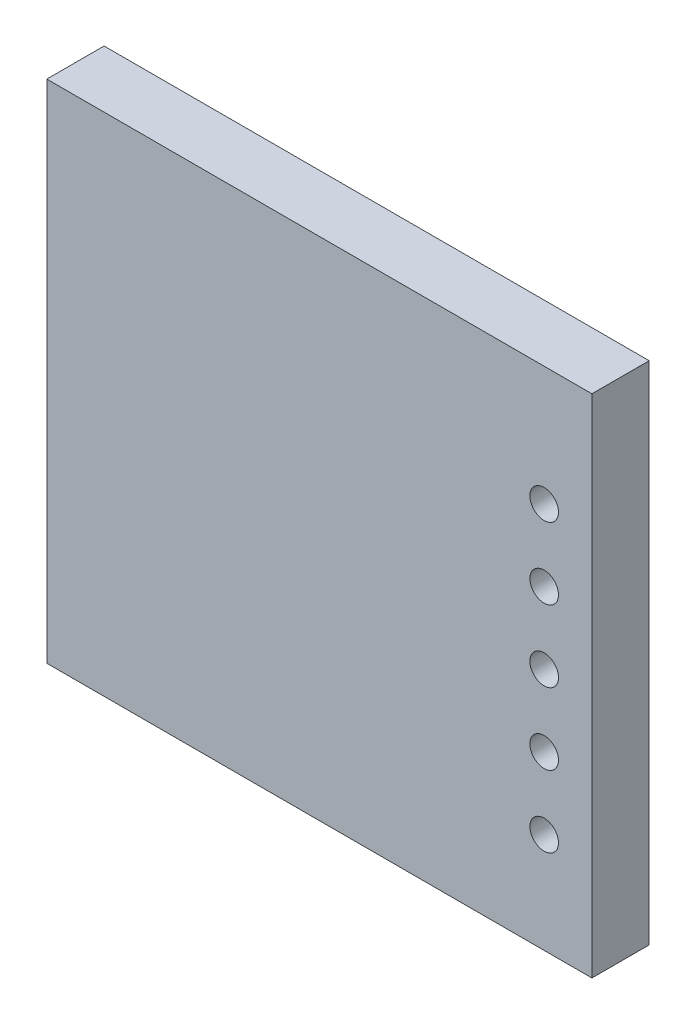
ISO-10303-21;
HEADER;
FILE_DESCRIPTION(('STEP AP214'),'2;1');
FILE_NAME('part.step','',(''),(''),'','','');
FILE_SCHEMA(('AUTOMOTIVE_DESIGN { 1 0 10303 214 1 1 1 1 }'));
ENDSEC;
DATA;
#1=APPLICATION_CONTEXT('core data for automotive mechanical design processes');
#2=APPLICATION_PROTOCOL_DEFINITION('international standard','automotive_design',2000,#1);
#3=PRODUCT_CONTEXT('',#1,'mechanical');
#4=PRODUCT('Part','Part','',(#3));
#5=PRODUCT_RELATED_PRODUCT_CATEGORY('part','',(#4));
#6=PRODUCT_DEFINITION_FORMATION('','',#4);
#7=PRODUCT_DEFINITION_CONTEXT('part definition',#1,'design');
#8=PRODUCT_DEFINITION('design','',#6,#7);
#9=PRODUCT_DEFINITION_SHAPE('','',#8);
#10=(LENGTH_UNIT() NAMED_UNIT(*) SI_UNIT(.MILLI.,.METRE.));
#11=(NAMED_UNIT(*) PLANE_ANGLE_UNIT() SI_UNIT($,.RADIAN.));
#12=(NAMED_UNIT(*) SI_UNIT($,.STERADIAN.) SOLID_ANGLE_UNIT());
#13=UNCERTAINTY_MEASURE_WITH_UNIT(LENGTH_MEASURE(1.E-05),#10,'distance_accuracy_value','');
#14=(GEOMETRIC_REPRESENTATION_CONTEXT(3) GLOBAL_UNCERTAINTY_ASSIGNED_CONTEXT((#13)) GLOBAL_UNIT_ASSIGNED_CONTEXT((#10,
#11,#12)) REPRESENTATION_CONTEXT('',''));
#15=CARTESIAN_POINT('',(0.,0.,0.));
#16=DIRECTION('',(0.,0.,1.));
#17=DIRECTION('',(1.,0.,0.));
#18=AXIS2_PLACEMENT_3D('',#15,#16,#17);
#19=CARTESIAN_POINT('',(0.,0.,1.524));
#20=DIRECTION('',(1.,0.,0.));
#21=DIRECTION('',(0.,0.,-1.));
#22=AXIS2_PLACEMENT_3D('',#19,#20,#21);
#23=PLANE('',#22);
#24=DIRECTION('',(0.,-1.,0.));
#25=VECTOR('',#24,1.);
#26=CARTESIAN_POINT('',(0.,0.,0.));
#27=LINE('',#26,#25);
#28=CARTESIAN_POINT('',(0.,13.462,0.));
#29=VERTEX_POINT('',#28);
#30=CARTESIAN_POINT('',(0.,0.,0.));
#31=VERTEX_POINT('',#30);
#32=EDGE_CURVE('E116',#29,#31,#27,.T.);
#33=ORIENTED_EDGE('',*,*,#32,.T.);
#34=DIRECTION('',(0.,0.,-1.));
#35=VECTOR('',#34,1.);
#36=CARTESIAN_POINT('',(0.,0.,1.524));
#37=LINE('',#36,#35);
#38=CARTESIAN_POINT('',(0.,0.,1.524));
#39=VERTEX_POINT('',#38);
#40=EDGE_CURVE('E11',#39,#31,#37,.T.);
#41=ORIENTED_EDGE('',*,*,#40,.F.);
#42=DIRECTION('',(0.,-1.,0.));
#43=VECTOR('',#42,1.);
#44=CARTESIAN_POINT('',(0.,0.,1.524));
#45=LINE('',#44,#43);
#46=CARTESIAN_POINT('',(0.,13.462,1.524));
#47=VERTEX_POINT('',#46);
#48=EDGE_CURVE('E99',#47,#39,#45,.T.);
#49=ORIENTED_EDGE('',*,*,#48,.F.);
#50=DIRECTION('',(0.,0.,-1.));
#51=VECTOR('',#50,1.);
#52=CARTESIAN_POINT('',(0.,13.462,1.524));
#53=LINE('',#52,#51);
#54=EDGE_CURVE('E112',#47,#29,#53,.T.);
#55=ORIENTED_EDGE('',*,*,#54,.T.);
#56=EDGE_LOOP('',(#33,#41,#49,#55));
#57=FACE_BOUND('',#56,.T.);
#58=ADVANCED_FACE('F45',(#57),#23,.F.);
#59=CARTESIAN_POINT('',(0.,0.,1.524));
#60=DIRECTION('',(0.,1.,0.));
#61=DIRECTION('',(0.,0.,1.));
#62=AXIS2_PLACEMENT_3D('',#59,#60,#61);
#63=PLANE('',#62);
#64=DIRECTION('',(1.,0.,0.));
#65=VECTOR('',#64,1.);
#66=CARTESIAN_POINT('',(0.,0.,0.));
#67=LINE('',#66,#65);
#68=CARTESIAN_POINT('',(14.5034,0.,0.));
#69=VERTEX_POINT('',#68);
#70=EDGE_CURVE('E104',#31,#69,#67,.T.);
#71=ORIENTED_EDGE('',*,*,#70,.T.);
#72=DIRECTION('',(0.,0.,-1.));
#73=VECTOR('',#72,1.);
#74=CARTESIAN_POINT('',(14.5034,0.,1.524));
#75=LINE('',#74,#73);
#76=CARTESIAN_POINT('',(14.5034,0.,1.524));
#77=VERTEX_POINT('',#76);
#78=EDGE_CURVE('E55',#77,#69,#75,.T.);
#79=ORIENTED_EDGE('',*,*,#78,.F.);
#80=DIRECTION('',(1.,0.,0.));
#81=VECTOR('',#80,1.);
#82=CARTESIAN_POINT('',(0.,0.,1.524));
#83=LINE('',#82,#81);
#84=EDGE_CURVE('E94',#39,#77,#83,.T.);
#85=ORIENTED_EDGE('',*,*,#84,.F.);
#86=ORIENTED_EDGE('',*,*,#40,.T.);
#87=EDGE_LOOP('',(#71,#79,#85,#86));
#88=FACE_BOUND('',#87,.T.);
#89=ADVANCED_FACE('F103',(#88),#63,.F.);
#90=CARTESIAN_POINT('',(14.5034,0.,1.524));
#91=DIRECTION('',(-1.,0.,0.));
#92=DIRECTION('',(0.,0.,1.));
#93=AXIS2_PLACEMENT_3D('',#90,#91,#92);
#94=PLANE('',#93);
#95=DIRECTION('',(0.,1.,0.));
#96=VECTOR('',#95,1.);
#97=CARTESIAN_POINT('',(14.5034,0.,0.));
#98=LINE('',#97,#96);
#99=CARTESIAN_POINT('',(14.5034,13.462,0.));
#100=VERTEX_POINT('',#99);
#101=EDGE_CURVE('E81',#69,#100,#98,.T.);
#102=ORIENTED_EDGE('',*,*,#101,.T.);
#103=DIRECTION('',(0.,0.,-1.));
#104=VECTOR('',#103,1.);
#105=CARTESIAN_POINT('',(14.5034,13.462,1.524));
#106=LINE('',#105,#104);
#107=CARTESIAN_POINT('',(14.5034,13.462,1.524));
#108=VERTEX_POINT('',#107);
#109=EDGE_CURVE('E106',#108,#100,#106,.T.);
#110=ORIENTED_EDGE('',*,*,#109,.F.);
#111=DIRECTION('',(0.,1.,0.));
#112=VECTOR('',#111,1.);
#113=CARTESIAN_POINT('',(14.5034,0.,1.524));
#114=LINE('',#113,#112);
#115=EDGE_CURVE('E97',#77,#108,#114,.T.);
#116=ORIENTED_EDGE('',*,*,#115,.F.);
#117=ORIENTED_EDGE('',*,*,#78,.T.);
#118=EDGE_LOOP('',(#102,#110,#116,#117));
#119=FACE_BOUND('',#118,.T.);
#120=ADVANCED_FACE('F108',(#119),#94,.F.);
#121=CARTESIAN_POINT('',(0.,13.462,1.524));
#122=DIRECTION('',(0.,-1.,0.));
#123=DIRECTION('',(0.,0.,-1.));
#124=AXIS2_PLACEMENT_3D('',#121,#122,#123);
#125=PLANE('',#124);
#126=DIRECTION('',(-1.,0.,0.));
#127=VECTOR('',#126,1.);
#128=CARTESIAN_POINT('',(0.,13.462,0.));
#129=LINE('',#128,#127);
#130=EDGE_CURVE('E87',#100,#29,#129,.T.);
#131=ORIENTED_EDGE('',*,*,#130,.T.);
#132=ORIENTED_EDGE('',*,*,#54,.F.);
#133=DIRECTION('',(-1.,0.,0.));
#134=VECTOR('',#133,1.);
#135=CARTESIAN_POINT('',(0.,13.462,1.524));
#136=LINE('',#135,#134);
#137=EDGE_CURVE('E64',#108,#47,#136,.T.);
#138=ORIENTED_EDGE('',*,*,#137,.F.);
#139=ORIENTED_EDGE('',*,*,#109,.T.);
#140=EDGE_LOOP('',(#131,#132,#138,#139));
#141=FACE_BOUND('',#140,.T.);
#142=ADVANCED_FACE('F168',(#141),#125,.F.);
#143=CARTESIAN_POINT('',(0.,0.,1.524));
#144=DIRECTION('',(0.,0.,-1.));
#145=DIRECTION('',(-1.,0.,0.));
#146=AXIS2_PLACEMENT_3D('',#143,#144,#145);
#147=PLANE('',#146);
#148=CARTESIAN_POINT('',(13.2334,10.287,1.524));
#149=DIRECTION('',(0.,0.,1.));
#150=DIRECTION('',(1.,0.,0.));
#151=AXIS2_PLACEMENT_3D('',#148,#149,#150);
#152=CIRCLE('',#151,0.381);
#153=CARTESIAN_POINT('',(13.6144,10.287,1.524));
#154=VERTEX_POINT('',#153);
#155=EDGE_CURVE('E135',#154,#154,#152,.T.);
#156=ORIENTED_EDGE('',*,*,#155,.F.);
#157=EDGE_LOOP('',(#156));
#158=FACE_BOUND('',#157,.T.);
#159=CARTESIAN_POINT('',(13.2334,8.382,1.524));
#160=DIRECTION('',(0.,0.,1.));
#161=DIRECTION('',(1.,0.,0.));
#162=AXIS2_PLACEMENT_3D('',#159,#160,#161);
#163=CIRCLE('',#162,0.381);
#164=CARTESIAN_POINT('',(13.6144,8.382,1.524));
#165=VERTEX_POINT('',#164);
#166=EDGE_CURVE('E258',#165,#165,#163,.T.);
#167=ORIENTED_EDGE('',*,*,#166,.F.);
#168=EDGE_LOOP('',(#167));
#169=FACE_BOUND('',#168,.T.);
#170=CARTESIAN_POINT('',(13.2334,6.477,1.524));
#171=DIRECTION('',(0.,0.,1.));
#172=DIRECTION('',(1.,0.,0.));
#173=AXIS2_PLACEMENT_3D('',#170,#171,#172);
#174=CIRCLE('',#173,0.381);
#175=CARTESIAN_POINT('',(13.6144,6.477,1.524));
#176=VERTEX_POINT('',#175);
#177=EDGE_CURVE('E261',#176,#176,#174,.T.);
#178=ORIENTED_EDGE('',*,*,#177,.F.);
#179=EDGE_LOOP('',(#178));
#180=FACE_BOUND('',#179,.T.);
#181=CARTESIAN_POINT('',(13.2334,4.572,1.524));
#182=DIRECTION('',(0.,0.,1.));
#183=DIRECTION('',(1.,0.,0.));
#184=AXIS2_PLACEMENT_3D('',#181,#182,#183);
#185=CIRCLE('',#184,0.381);
#186=CARTESIAN_POINT('',(13.6144,4.572,1.524));
#187=VERTEX_POINT('',#186);
#188=EDGE_CURVE('E268',#187,#187,#185,.T.);
#189=ORIENTED_EDGE('',*,*,#188,.F.);
#190=EDGE_LOOP('',(#189));
#191=FACE_BOUND('',#190,.T.);
#192=CARTESIAN_POINT('',(13.2334,2.667,1.524));
#193=DIRECTION('',(0.,0.,1.));
#194=DIRECTION('',(1.,0.,0.));
#195=AXIS2_PLACEMENT_3D('',#192,#193,#194);
#196=CIRCLE('',#195,0.381);
#197=CARTESIAN_POINT('',(13.6144,2.667,1.524));
#198=VERTEX_POINT('',#197);
#199=EDGE_CURVE('E274',#198,#198,#196,.T.);
#200=ORIENTED_EDGE('',*,*,#199,.F.);
#201=EDGE_LOOP('',(#200));
#202=FACE_BOUND('',#201,.T.);
#203=ORIENTED_EDGE('',*,*,#48,.T.);
#204=ORIENTED_EDGE('',*,*,#84,.T.);
#205=ORIENTED_EDGE('',*,*,#115,.T.);
#206=ORIENTED_EDGE('',*,*,#137,.T.);
#207=EDGE_LOOP('',(#203,#204,#205,#206));
#208=FACE_BOUND('',#207,.T.);
#209=ADVANCED_FACE('F95',(#158,#169,#180,#191,#202,#208),#147,.F.);
#210=CARTESIAN_POINT('',(0.,0.,0.));
#211=DIRECTION('',(0.,0.,-1.));
#212=DIRECTION('',(-1.,0.,0.));
#213=AXIS2_PLACEMENT_3D('',#210,#211,#212);
#214=PLANE('',#213);
#215=CARTESIAN_POINT('',(13.2334,10.287,0.));
#216=DIRECTION('',(0.,0.,-1.));
#217=DIRECTION('',(-1.,0.,0.));
#218=AXIS2_PLACEMENT_3D('',#215,#216,#217);
#219=CIRCLE('',#218,0.381);
#220=CARTESIAN_POINT('',(12.8524,10.287,0.));
#221=VERTEX_POINT('',#220);
#222=EDGE_CURVE('E48',#221,#221,#219,.T.);
#223=ORIENTED_EDGE('',*,*,#222,.F.);
#224=EDGE_LOOP('',(#223));
#225=FACE_BOUND('',#224,.T.);
#226=CARTESIAN_POINT('',(13.2334,8.382,0.));
#227=DIRECTION('',(0.,0.,-1.));
#228=DIRECTION('',(-1.,0.,0.));
#229=AXIS2_PLACEMENT_3D('',#226,#227,#228);
#230=CIRCLE('',#229,0.381);
#231=CARTESIAN_POINT('',(12.8524,8.382,0.));
#232=VERTEX_POINT('',#231);
#233=EDGE_CURVE('E142',#232,#232,#230,.T.);
#234=ORIENTED_EDGE('',*,*,#233,.F.);
#235=EDGE_LOOP('',(#234));
#236=FACE_BOUND('',#235,.T.);
#237=CARTESIAN_POINT('',(13.2334,6.477,0.));
#238=DIRECTION('',(0.,0.,-1.));
#239=DIRECTION('',(-1.,0.,0.));
#240=AXIS2_PLACEMENT_3D('',#237,#238,#239);
#241=CIRCLE('',#240,0.381);
#242=CARTESIAN_POINT('',(12.8524,6.477,0.));
#243=VERTEX_POINT('',#242);
#244=EDGE_CURVE('E139',#243,#243,#241,.T.);
#245=ORIENTED_EDGE('',*,*,#244,.F.);
#246=EDGE_LOOP('',(#245));
#247=FACE_BOUND('',#246,.T.);
#248=CARTESIAN_POINT('',(13.2334,4.572,0.));
#249=DIRECTION('',(0.,0.,-1.));
#250=DIRECTION('',(-1.,0.,0.));
#251=AXIS2_PLACEMENT_3D('',#248,#249,#250);
#252=CIRCLE('',#251,0.381);
#253=CARTESIAN_POINT('',(12.8524,4.572,0.));
#254=VERTEX_POINT('',#253);
#255=EDGE_CURVE('E134',#254,#254,#252,.T.);
#256=ORIENTED_EDGE('',*,*,#255,.F.);
#257=EDGE_LOOP('',(#256));
#258=FACE_BOUND('',#257,.T.);
#259=CARTESIAN_POINT('',(13.2334,2.667,0.));
#260=DIRECTION('',(0.,0.,-1.));
#261=DIRECTION('',(-1.,0.,0.));
#262=AXIS2_PLACEMENT_3D('',#259,#260,#261);
#263=CIRCLE('',#262,0.381);
#264=CARTESIAN_POINT('',(12.8524,2.667,0.));
#265=VERTEX_POINT('',#264);
#266=EDGE_CURVE('E130',#265,#265,#263,.T.);
#267=ORIENTED_EDGE('',*,*,#266,.F.);
#268=EDGE_LOOP('',(#267));
#269=FACE_BOUND('',#268,.T.);
#270=ORIENTED_EDGE('',*,*,#32,.F.);
#271=ORIENTED_EDGE('',*,*,#130,.F.);
#272=ORIENTED_EDGE('',*,*,#101,.F.);
#273=ORIENTED_EDGE('',*,*,#70,.F.);
#274=EDGE_LOOP('',(#270,#271,#272,#273));
#275=FACE_BOUND('',#274,.T.);
#276=ADVANCED_FACE('F154',(#225,#236,#247,#258,#269,#275),#214,.T.);
#277=CARTESIAN_POINT('',(13.2334,2.667,-4.572));
#278=DIRECTION('',(0.,0.,1.));
#279=DIRECTION('',(1.,0.,0.));
#280=AXIS2_PLACEMENT_3D('',#277,#278,#279);
#281=CYLINDRICAL_SURFACE('',#280,0.381);
#282=ORIENTED_EDGE('',*,*,#266,.T.);
#283=EDGE_LOOP('',(#282));
#284=FACE_BOUND('',#283,.T.);
#285=ORIENTED_EDGE('',*,*,#199,.T.);
#286=EDGE_LOOP('',(#285));
#287=FACE_BOUND('',#286,.T.);
#288=ADVANCED_FACE('F157',(#284,#287),#281,.F.);
#289=CARTESIAN_POINT('',(13.2334,4.572,-4.572));
#290=DIRECTION('',(0.,0.,1.));
#291=DIRECTION('',(1.,0.,0.));
#292=AXIS2_PLACEMENT_3D('',#289,#290,#291);
#293=CYLINDRICAL_SURFACE('',#292,0.381);
#294=ORIENTED_EDGE('',*,*,#255,.T.);
#295=EDGE_LOOP('',(#294));
#296=FACE_BOUND('',#295,.T.);
#297=ORIENTED_EDGE('',*,*,#188,.T.);
#298=EDGE_LOOP('',(#297));
#299=FACE_BOUND('',#298,.T.);
#300=ADVANCED_FACE('F215',(#296,#299),#293,.F.);
#301=CARTESIAN_POINT('',(13.2334,6.477,-4.572));
#302=DIRECTION('',(0.,0.,1.));
#303=DIRECTION('',(1.,0.,0.));
#304=AXIS2_PLACEMENT_3D('',#301,#302,#303);
#305=CYLINDRICAL_SURFACE('',#304,0.381);
#306=ORIENTED_EDGE('',*,*,#244,.T.);
#307=EDGE_LOOP('',(#306));
#308=FACE_BOUND('',#307,.T.);
#309=ORIENTED_EDGE('',*,*,#177,.T.);
#310=EDGE_LOOP('',(#309));
#311=FACE_BOUND('',#310,.T.);
#312=ADVANCED_FACE('F225',(#308,#311),#305,.F.);
#313=CARTESIAN_POINT('',(13.2334,8.382,-4.572));
#314=DIRECTION('',(0.,0.,1.));
#315=DIRECTION('',(1.,0.,0.));
#316=AXIS2_PLACEMENT_3D('',#313,#314,#315);
#317=CYLINDRICAL_SURFACE('',#316,0.381);
#318=ORIENTED_EDGE('',*,*,#233,.T.);
#319=EDGE_LOOP('',(#318));
#320=FACE_BOUND('',#319,.T.);
#321=ORIENTED_EDGE('',*,*,#166,.T.);
#322=EDGE_LOOP('',(#321));
#323=FACE_BOUND('',#322,.T.);
#324=ADVANCED_FACE('F235',(#320,#323),#317,.F.);
#325=CARTESIAN_POINT('',(13.2334,10.287,-4.572));
#326=DIRECTION('',(0.,0.,1.));
#327=DIRECTION('',(1.,0.,0.));
#328=AXIS2_PLACEMENT_3D('',#325,#326,#327);
#329=CYLINDRICAL_SURFACE('',#328,0.381);
#330=ORIENTED_EDGE('',*,*,#222,.T.);
#331=EDGE_LOOP('',(#330));
#332=FACE_BOUND('',#331,.T.);
#333=ORIENTED_EDGE('',*,*,#155,.T.);
#334=EDGE_LOOP('',(#333));
#335=FACE_BOUND('',#334,.T.);
#336=ADVANCED_FACE('F151',(#332,#335),#329,.F.);
#337=CLOSED_SHELL('',(#58,#89,#120,#142,#209,#276,#288,#300,#312,#324,#336));
#338=MANIFOLD_SOLID_BREP('B2',#337);
#339=ADVANCED_BREP_SHAPE_REPRESENTATION('',(#18,#338),#14);
#340=SHAPE_DEFINITION_REPRESENTATION(#9,#339);
ENDSEC;
END-ISO-10303-21;
